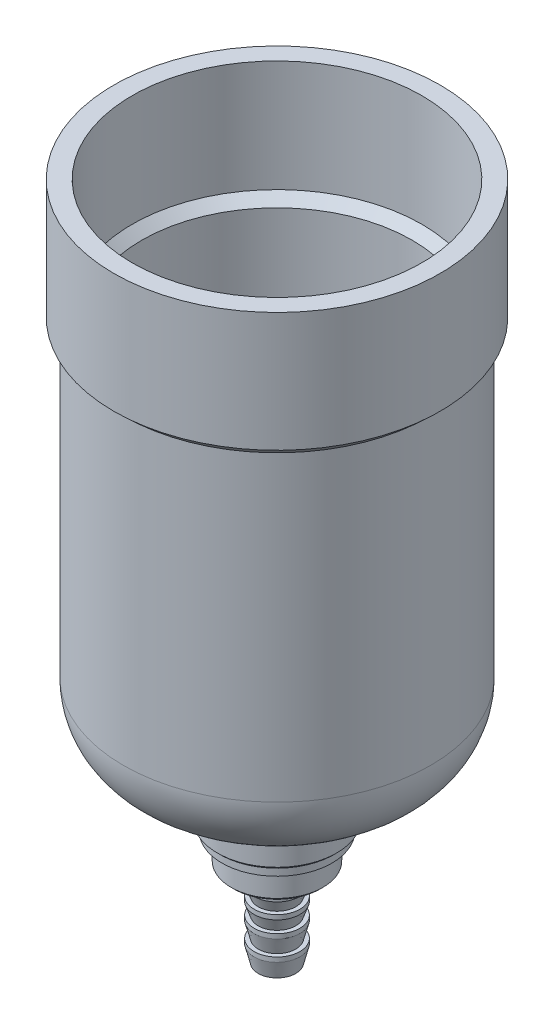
from build123d import *


with BuildPart() as part:
    # Sketch 1 → Revolve 1 (revolve)
    with BuildSketch(Plane.XY, mode=Mode.PRIVATE) as revolve_1_sk:
        with BuildLine():
            Line((-17.8, -13.02085916), (-16.75, -14))
            Line((-16.75, -14), (-16.75, -47))
            ThreePointArc((-16.75, -47), (-14.406854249, -52.656854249), (-8.75, -55))
            Line((-8.75, -55), (-7.5, -55))
            ThreePointArc((-7.5, -55), (-6.792893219, -55.292893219), (-6.5, -56))
            Line((-6.5, -56), (-6.5, -60.4))
            Line((-6.5, -60.4), (-6.2, -60.7))
            Line((-6.2, -60.7), (-6, -60.7))
            Line((-6, -60.7), (-6, -61.6))
            Line((-6, -61.6), (-5, -61.6))
            Line((-5, -61.6), (-5, -64.4))
            Line((-5, -64.4), (-4.7, -64.7))
            Line((-4.7, -64.7), (-3.5, -64.7))
            Line((-3.5, -64.7), (-3.5, -65.5))
            Line((-3.5, -65.5), (-2.5, -65.5))
            Line((-2.5, -65.5), (-2.5, -66.5))
            Line((-2.5, -66.5), (-2.05, -67.7))
            Line((-2.05, -67.7), (-2.5, -67.7))
            Line((-2.5, -67.7), (-2.5, -68.2))
            Line((-2.5, -68.2), (-2.05, -69.5))
            Line((-2.05, -69.5), (-2.5, -69.5))
            Line((-2.5, -69.5), (-2.5, -70))
            Line((-2.5, -70), (-2.05, -71.7))
            Line((-2.05, -71.7), (-2.5, -71.7))
            Line((-2.5, -71.7), (-2.5, -72.2))
            Line((-2.5, -72.2), (-2.05, -74))
            Line((-2.05, -74), (-1.2, -74))
            Line((-1.2, -74), (-1.2, -53))
            Line((-1.2, -53), (-6.75, -53))
            ThreePointArc((-6.75, -53), (-12.406854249, -50.656854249), (-14.75, -45))
            Line((-14.75, -45), (-14.75, -13.13037525))
            Line((-14.75, -13.13037525), (-15.8, -12.15123441))
            Line((-15.8, -12.15123441), (-15.8, 0))
            Line((-15.8, 0), (-17.8, 0))
            Line((-17.8, 0), (-17.8, -13.02085916))
        make_face()
    revolve(revolve_1_sk.sketch.rotate(Axis((0, 0, 0), (0, -1, 0)), 90), axis=Axis((0, 0, 0), (0, -1, 0)))


solid = part.part
